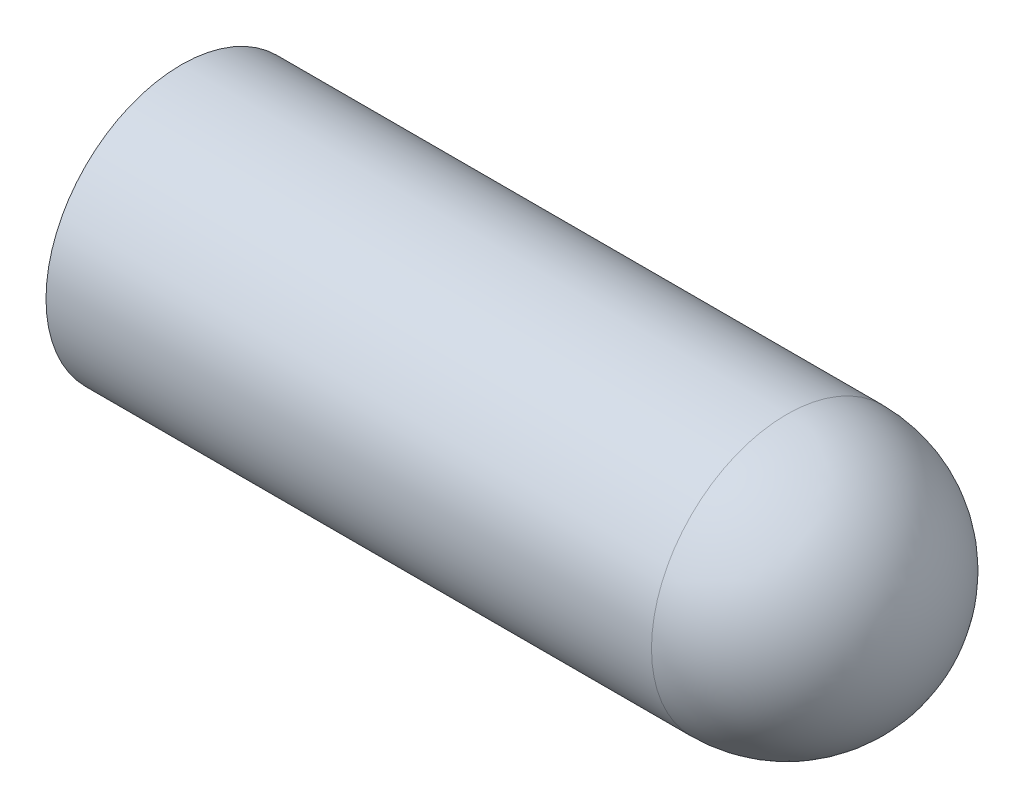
from build123d import *

# Parameters (mm, degrees)
SHELL1_T = -0.6


with BuildPart() as part:
    # Sketch2 → Revolve6 (revolve)
    with BuildSketch(Plane.XY):
        with BuildLine():
            Line((21.05, 0), (-14.55, 0))
            Line((-14.55, 0), (-14.55, 6.5))
            Line((-14.55, 6.5), (14.55, 6.5))
            ThreePointArc((14.55, 6.5), (19.146194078, 4.596194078), (21.05, 0))
        make_face()
    revolve(axis=Axis((21.05, 0, 0), (-1, 0, 0)))

    # Shell1
    shell1_openings = [part.faces().sort_by_distance(p)[0] for p in [
        (-14.55, 0, 0),
    ]]
    offset(amount=SHELL1_T, openings=shell1_openings, kind=Kind.INTERSECTION)


solid = part.part
